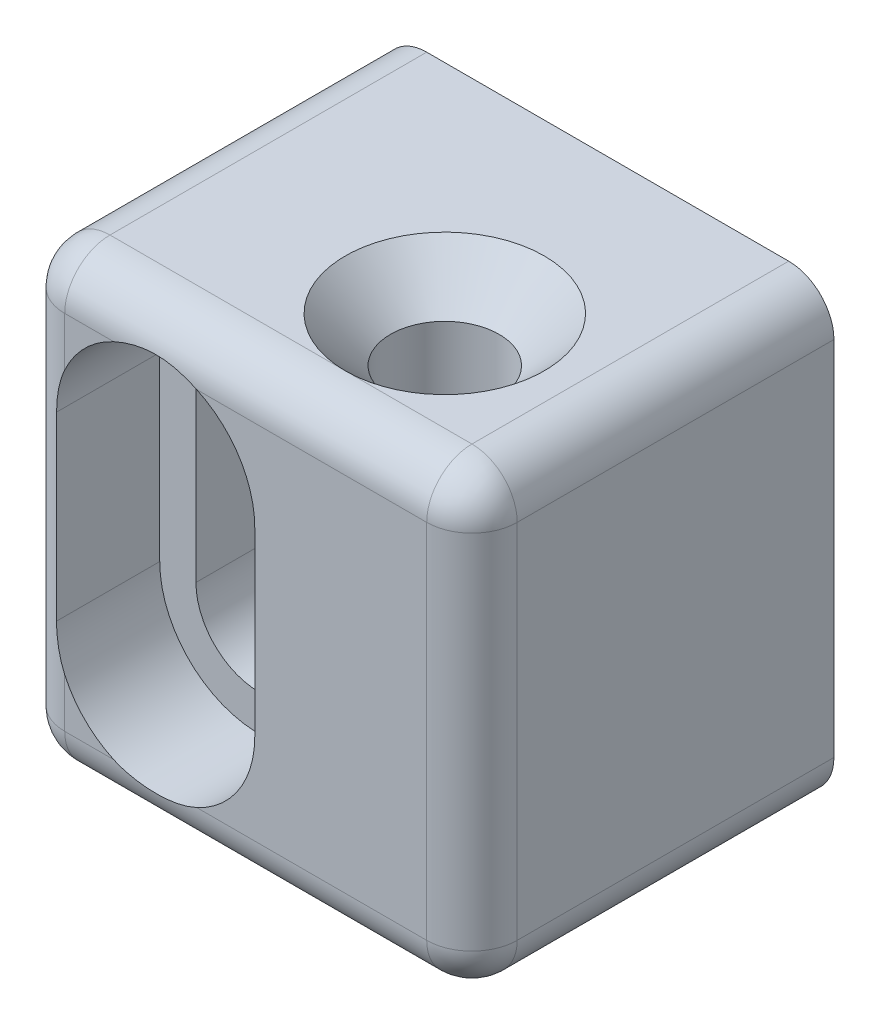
ISO-10303-21;
HEADER;
FILE_DESCRIPTION(('STEP AP214'),'2;1');
FILE_NAME('part.step','',(''),(''),'','','');
FILE_SCHEMA(('AUTOMOTIVE_DESIGN { 1 0 10303 214 1 1 1 1 }'));
ENDSEC;
DATA;
#1=APPLICATION_CONTEXT('core data for automotive mechanical design processes');
#2=APPLICATION_PROTOCOL_DEFINITION('international standard','automotive_design',2000,#1);
#3=PRODUCT_CONTEXT('',#1,'mechanical');
#4=PRODUCT('Part','Part','',(#3));
#5=PRODUCT_RELATED_PRODUCT_CATEGORY('part','',(#4));
#6=PRODUCT_DEFINITION_FORMATION('','',#4);
#7=PRODUCT_DEFINITION_CONTEXT('part definition',#1,'design');
#8=PRODUCT_DEFINITION('design','',#6,#7);
#9=PRODUCT_DEFINITION_SHAPE('','',#8);
#10=(LENGTH_UNIT() NAMED_UNIT(*) SI_UNIT(.MILLI.,.METRE.));
#11=(NAMED_UNIT(*) PLANE_ANGLE_UNIT() SI_UNIT($,.RADIAN.));
#12=(NAMED_UNIT(*) SI_UNIT($,.STERADIAN.) SOLID_ANGLE_UNIT());
#13=UNCERTAINTY_MEASURE_WITH_UNIT(LENGTH_MEASURE(1.E-05),#10,'distance_accuracy_value','');
#14=(GEOMETRIC_REPRESENTATION_CONTEXT(3) GLOBAL_UNCERTAINTY_ASSIGNED_CONTEXT((#13)) GLOBAL_UNIT_ASSIGNED_CONTEXT((#10,
#11,#12)) REPRESENTATION_CONTEXT('',''));
#15=CARTESIAN_POINT('',(0.,0.,0.));
#16=DIRECTION('',(0.,0.,1.));
#17=DIRECTION('',(1.,0.,0.));
#18=AXIS2_PLACEMENT_3D('',#15,#16,#17);
#19=CARTESIAN_POINT('',(-10.,12.5,0.));
#20=DIRECTION('',(0.,1.,0.));
#21=DIRECTION('',(0.,0.,1.));
#22=AXIS2_PLACEMENT_3D('',#19,#20,#21);
#23=PLANE('',#22);
#24=DIRECTION('',(0.,0.,1.));
#25=VECTOR('',#24,1.);
#26=CARTESIAN_POINT('',(10.,12.5,0.));
#27=LINE('',#26,#25);
#28=CARTESIAN_POINT('',(10.,12.5,17.5));
#29=VERTEX_POINT('',#28);
#30=CARTESIAN_POINT('',(10.,12.5,0.));
#31=VERTEX_POINT('',#30);
#32=EDGE_CURVE('E360',#29,#31,#27,.F.);
#33=ORIENTED_EDGE('',*,*,#32,.T.);
#34=DIRECTION('',(1.,0.,0.));
#35=VECTOR('',#34,1.);
#36=CARTESIAN_POINT('',(-10.,12.5,0.));
#37=LINE('',#36,#35);
#38=CARTESIAN_POINT('',(-10.,12.5,0.));
#39=VERTEX_POINT('',#38);
#40=EDGE_CURVE('E368',#31,#39,#37,.F.);
#41=ORIENTED_EDGE('',*,*,#40,.T.);
#42=DIRECTION('',(0.,0.,1.));
#43=VECTOR('',#42,1.);
#44=CARTESIAN_POINT('',(-10.,12.5,0.));
#45=LINE('',#44,#43);
#46=CARTESIAN_POINT('',(-10.,12.5,17.5));
#47=VERTEX_POINT('',#46);
#48=EDGE_CURVE('E353',#47,#39,#45,.F.);
#49=ORIENTED_EDGE('',*,*,#48,.F.);
#50=DIRECTION('',(1.,0.,0.));
#51=VECTOR('',#50,1.);
#52=CARTESIAN_POINT('',(-10.,12.5,17.5));
#53=LINE('',#52,#51);
#54=CARTESIAN_POINT('',(3.,12.5,17.5));
#55=VERTEX_POINT('',#54);
#56=EDGE_CURVE('E216',#47,#55,#53,.T.);
#57=ORIENTED_EDGE('',*,*,#56,.T.);
#58=CARTESIAN_POINT('',(3.,12.5,12.));
#59=DIRECTION('',(0.,1.,0.));
#60=DIRECTION('',(0.,0.,1.));
#61=AXIS2_PLACEMENT_3D('',#58,#59,#60);
#62=CIRCLE('',#61,5.5);
#63=EDGE_CURVE('E32',#55,#55,#62,.F.);
#64=ORIENTED_EDGE('',*,*,#63,.T.);
#65=EDGE_CURVE('E425',#55,#29,#53,.T.);
#66=ORIENTED_EDGE('',*,*,#65,.T.);
#67=EDGE_LOOP('',(#33,#41,#49,#57,#64,#66));
#68=FACE_BOUND('',#67,.T.);
#69=ADVANCED_FACE('F15',(#68),#23,.T.);
#70=CARTESIAN_POINT('',(3.,-12.5,12.));
#71=DIRECTION('',(0.,-1.,0.));
#72=DIRECTION('',(0.,0.,-1.));
#73=AXIS2_PLACEMENT_3D('',#70,#71,#72);
#74=CONICAL_SURFACE('',#73,5.5,0.785398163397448);
#75=CARTESIAN_POINT('',(3.,-10.,12.));
#76=DIRECTION('',(0.,-1.,0.));
#77=DIRECTION('',(0.,0.,-1.));
#78=AXIS2_PLACEMENT_3D('',#75,#76,#77);
#79=CIRCLE('',#78,3.);
#80=CARTESIAN_POINT('',(3.,-10.,9.));
#81=VERTEX_POINT('',#80);
#82=EDGE_CURVE('E340',#81,#81,#79,.T.);
#83=ORIENTED_EDGE('',*,*,#82,.F.);
#84=EDGE_LOOP('',(#83));
#85=FACE_BOUND('',#84,.T.);
#86=CARTESIAN_POINT('',(3.,-12.5,12.));
#87=DIRECTION('',(0.,-1.,0.));
#88=DIRECTION('',(0.,0.,-1.));
#89=AXIS2_PLACEMENT_3D('',#86,#87,#88);
#90=CIRCLE('',#89,5.5);
#91=CARTESIAN_POINT('',(3.,-12.5,17.5));
#92=VERTEX_POINT('',#91);
#93=EDGE_CURVE('E378',#92,#92,#90,.T.);
#94=ORIENTED_EDGE('',*,*,#93,.T.);
#95=EDGE_LOOP('',(#94));
#96=FACE_BOUND('',#95,.T.);
#97=ADVANCED_FACE('F265',(#85,#96),#74,.F.);
#98=CARTESIAN_POINT('',(3.,-10.,12.));
#99=DIRECTION('',(0.,1.,0.));
#100=DIRECTION('',(0.,0.,1.));
#101=AXIS2_PLACEMENT_3D('',#98,#99,#100);
#102=CYLINDRICAL_SURFACE('',#101,3.);
#103=ORIENTED_EDGE('',*,*,#82,.T.);
#104=EDGE_LOOP('',(#103));
#105=FACE_BOUND('',#104,.T.);
#106=CARTESIAN_POINT('',(3.,10.,12.));
#107=DIRECTION('',(0.,1.,0.));
#108=DIRECTION('',(0.,0.,1.));
#109=AXIS2_PLACEMENT_3D('',#106,#107,#108);
#110=CIRCLE('',#109,3.);
#111=CARTESIAN_POINT('',(3.,10.,15.));
#112=VERTEX_POINT('',#111);
#113=EDGE_CURVE('E343',#112,#112,#110,.T.);
#114=ORIENTED_EDGE('',*,*,#113,.T.);
#115=EDGE_LOOP('',(#114));
#116=FACE_BOUND('',#115,.T.);
#117=ADVANCED_FACE('F431',(#105,#116),#102,.F.);
#118=CARTESIAN_POINT('',(3.,12.5,12.));
#119=DIRECTION('',(0.,1.,0.));
#120=DIRECTION('',(0.,0.,1.));
#121=AXIS2_PLACEMENT_3D('',#118,#119,#120);
#122=CONICAL_SURFACE('',#121,5.5,0.785398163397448);
#123=ORIENTED_EDGE('',*,*,#113,.F.);
#124=EDGE_LOOP('',(#123));
#125=FACE_BOUND('',#124,.T.);
#126=ORIENTED_EDGE('',*,*,#63,.F.);
#127=EDGE_LOOP('',(#126));
#128=FACE_BOUND('',#127,.T.);
#129=ADVANCED_FACE('F429',(#125,#128),#122,.F.);
#130=CARTESIAN_POINT('',(5.,-10.,17.5));
#131=DIRECTION('',(-1.,0.,0.));
#132=DIRECTION('',(0.,0.,1.));
#133=AXIS2_PLACEMENT_3D('',#130,#131,#132);
#134=CYLINDRICAL_SURFACE('',#133,2.5);
#135=CARTESIAN_POINT('',(10.,-10.,17.5));
#136=DIRECTION('',(1.,0.,0.));
#137=DIRECTION('',(0.,1.,0.));
#138=AXIS2_PLACEMENT_3D('',#135,#136,#137);
#139=CIRCLE('',#138,2.5);
#140=CARTESIAN_POINT('',(10.,-10.,20.));
#141=VERTEX_POINT('',#140);
#142=CARTESIAN_POINT('',(9.999999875,-12.5,17.5));
#143=VERTEX_POINT('',#142);
#144=EDGE_CURVE('E160',#141,#143,#139,.T.);
#145=ORIENTED_EDGE('',*,*,#144,.F.);
#146=DIRECTION('',(-1.,0.,0.));
#147=VECTOR('',#146,1.);
#148=CARTESIAN_POINT('',(5.,-10.,20.));
#149=LINE('',#148,#147);
#150=CARTESIAN_POINT('',(-2.70871256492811,-10.,20.));
#151=VERTEX_POINT('',#150);
#152=EDGE_CURVE('E163',#141,#151,#149,.T.);
#153=ORIENTED_EDGE('',*,*,#152,.T.);
#154=CARTESIAN_POINT('',(-2.70871256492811,-10.,20.));
#155=CARTESIAN_POINT('',(-2.7782256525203,-10.0318550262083,19.9999964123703));
#156=CARTESIAN_POINT('',(-2.8483912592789,-10.062254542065,19.9993916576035));
#157=CARTESIAN_POINT('',(-2.98991172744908,-10.1200963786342,19.9972820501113));
#158=CARTESIAN_POINT('',(-3.06126649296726,-10.1475389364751,19.9957772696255));
#159=CARTESIAN_POINT('',(-3.27691854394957,-10.2253550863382,19.9903669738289));
#160=CARTESIAN_POINT('',(-3.42284164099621,-10.2712345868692,19.9855651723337));
#161=CARTESIAN_POINT('',(-3.71785320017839,-10.3506468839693,19.9756104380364));
#162=CARTESIAN_POINT('',(-3.86693911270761,-10.384189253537,19.9704577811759));
#163=CARTESIAN_POINT('',(-4.16742132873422,-10.4387610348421,19.961352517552));
#164=CARTESIAN_POINT('',(-4.3188175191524,-10.4597910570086,19.9573998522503));
#165=CARTESIAN_POINT('',(-4.62402693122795,-10.4892917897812,19.951698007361));
#166=CARTESIAN_POINT('',(-4.77784977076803,-10.4976665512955,19.9499656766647));
#167=CARTESIAN_POINT('',(-5.0856758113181,-10.5014864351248,19.9491866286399));
#168=CARTESIAN_POINT('',(-5.23967902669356,-10.4969304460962,19.9501401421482));
#169=CARTESIAN_POINT('',(-5.54656990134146,-10.4749337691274,19.9544984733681));
#170=CARTESIAN_POINT('',(-5.69945853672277,-10.4575062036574,19.9579007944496));
#171=CARTESIAN_POINT('',(-6.00314057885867,-10.4099290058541,19.9662799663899));
#172=CARTESIAN_POINT('',(-6.15393453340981,-10.3797827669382,19.9712563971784));
#173=CARTESIAN_POINT('',(-6.47291154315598,-10.3019824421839,19.9820479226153));
#174=CARTESIAN_POINT('',(-6.64065463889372,-10.2524986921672,19.9878846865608));
#175=CARTESIAN_POINT('',(-6.88805135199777,-10.166515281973,19.9946120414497));
#176=CARTESIAN_POINT('',(-6.96977113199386,-10.1359141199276,19.9965160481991));
#177=CARTESIAN_POINT('',(-7.1317056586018,-10.0708424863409,19.9992072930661));
#178=CARTESIAN_POINT('',(-7.21191987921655,-10.0363706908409,19.999994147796));
#179=CARTESIAN_POINT('',(-7.29128743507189,-10.,20.));
#180=B_SPLINE_CURVE_WITH_KNOTS('',3,(#154,#155,#156,#157,#158,#159,#160,#161,#162,#163,#164,
#165,#166,#167,#168,#169,#170,#171,#172,#173,#174,#175,#176,#177,#178,#179),.UNSPECIFIED.,.F.,
.F.,(4,2,2,2,2,2,2,2,2,2,2,2,4),(0.,0.229350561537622,0.458682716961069,0.917221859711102,
1.37540444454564,1.83356467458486,2.29518143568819,2.75683787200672,3.21802430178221,
3.67908776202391,4.20316272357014,4.46491890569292,4.72676489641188),.UNSPECIFIED.);
#181=CARTESIAN_POINT('',(-7.29128743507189,-10.,20.));
#182=VERTEX_POINT('',#181);
#183=EDGE_CURVE('E179',#151,#182,#180,.T.);
#184=ORIENTED_EDGE('',*,*,#183,.T.);
#185=DIRECTION('',(-1.,0.,0.));
#186=VECTOR('',#185,1.);
#187=CARTESIAN_POINT('',(5.,-10.,20.));
#188=LINE('',#187,#186);
#189=CARTESIAN_POINT('',(-10.,-10.,20.));
#190=VERTEX_POINT('',#189);
#191=EDGE_CURVE('E335',#182,#190,#188,.T.);
#192=ORIENTED_EDGE('',*,*,#191,.T.);
#193=CARTESIAN_POINT('',(-10.,-10.,17.5));
#194=DIRECTION('',(-1.,0.,0.));
#195=DIRECTION('',(0.,0.,1.));
#196=AXIS2_PLACEMENT_3D('',#193,#194,#195);
#197=CIRCLE('',#196,2.5);
#198=CARTESIAN_POINT('',(-10.,-12.5,17.5));
#199=VERTEX_POINT('',#198);
#200=EDGE_CURVE('E329',#190,#199,#197,.F.);
#201=ORIENTED_EDGE('',*,*,#200,.T.);
#202=DIRECTION('',(1.,0.,0.));
#203=VECTOR('',#202,1.);
#204=CARTESIAN_POINT('',(0.,-12.5,17.5));
#205=LINE('',#204,#203);
#206=EDGE_CURVE('E380',#199,#92,#205,.T.);
#207=ORIENTED_EDGE('',*,*,#206,.T.);
#208=DIRECTION('',(1.,0.,0.));
#209=VECTOR('',#208,1.);
#210=CARTESIAN_POINT('',(0.,-12.5,17.5));
#211=LINE('',#210,#209);
#212=EDGE_CURVE('E18',#92,#143,#211,.T.);
#213=ORIENTED_EDGE('',*,*,#212,.T.);
#214=EDGE_LOOP('',(#145,#153,#184,#192,#201,#207,#213));
#215=FACE_BOUND('',#214,.T.);
#216=ADVANCED_FACE('F162',(#215),#134,.T.);
#217=CARTESIAN_POINT('',(10.,-10.,17.5));
#218=DIRECTION('',(1.,0.,0.));
#219=DIRECTION('',(0.,1.,0.));
#220=AXIS2_PLACEMENT_3D('',#217,#218,#219);
#221=SPHERICAL_SURFACE('',#220,2.5);
#222=CARTESIAN_POINT('',(10.,-10.,17.5));
#223=DIRECTION('',(0.,0.,1.));
#224=DIRECTION('',(1.,0.,0.));
#225=AXIS2_PLACEMENT_3D('',#222,#223,#224);
#226=CIRCLE('',#225,2.5);
#227=CARTESIAN_POINT('',(12.5,-10.,17.5));
#228=VERTEX_POINT('',#227);
#229=EDGE_CURVE('E184',#228,#143,#226,.F.);
#230=ORIENTED_EDGE('',*,*,#229,.F.);
#231=CARTESIAN_POINT('',(10.,-10.,17.5));
#232=DIRECTION('',(0.,-1.,0.));
#233=DIRECTION('',(0.,0.,-1.));
#234=AXIS2_PLACEMENT_3D('',#231,#232,#233);
#235=CIRCLE('',#234,2.5);
#236=EDGE_CURVE('E182',#141,#228,#235,.F.);
#237=ORIENTED_EDGE('',*,*,#236,.F.);
#238=ORIENTED_EDGE('',*,*,#144,.T.);
#239=EDGE_LOOP('',(#230,#237,#238));
#240=FACE_BOUND('',#239,.T.);
#241=ADVANCED_FACE('F183',(#240),#221,.T.);
#242=CARTESIAN_POINT('',(0.,0.,0.));
#243=DIRECTION('',(0.,0.,1.));
#244=DIRECTION('',(1.,0.,0.));
#245=AXIS2_PLACEMENT_3D('',#242,#243,#244);
#246=PLANE('',#245);
#247=CARTESIAN_POINT('',(-5.,-4.99999981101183,0.));
#248=DIRECTION('',(0.,0.,1.));
#249=DIRECTION('',(1.,0.,0.));
#250=AXIS2_PLACEMENT_3D('',#247,#248,#249);
#251=CIRCLE('',#250,3.5);
#252=CARTESIAN_POINT('',(-1.5,-4.99999981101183,0.));
#253=VERTEX_POINT('',#252);
#254=CARTESIAN_POINT('',(-8.5,-4.99999981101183,0.));
#255=VERTEX_POINT('',#254);
#256=EDGE_CURVE('E188',#253,#255,#251,.F.);
#257=ORIENTED_EDGE('',*,*,#256,.F.);
#258=DIRECTION('',(0.,1.,0.));
#259=VECTOR('',#258,1.);
#260=CARTESIAN_POINT('',(-1.5,0.,0.));
#261=LINE('',#260,#259);
#262=CARTESIAN_POINT('',(-1.5,5.00000018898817,0.));
#263=VERTEX_POINT('',#262);
#264=EDGE_CURVE('E571',#263,#253,#261,.F.);
#265=ORIENTED_EDGE('',*,*,#264,.F.);
#266=CARTESIAN_POINT('',(-5.,5.00000018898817,0.));
#267=DIRECTION('',(0.,0.,1.));
#268=DIRECTION('',(1.,0.,0.));
#269=AXIS2_PLACEMENT_3D('',#266,#267,#268);
#270=CIRCLE('',#269,3.5);
#271=CARTESIAN_POINT('',(-8.5,5.00000018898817,0.));
#272=VERTEX_POINT('',#271);
#273=EDGE_CURVE('E567',#272,#263,#270,.F.);
#274=ORIENTED_EDGE('',*,*,#273,.F.);
#275=DIRECTION('',(0.,1.,0.));
#276=VECTOR('',#275,1.);
#277=CARTESIAN_POINT('',(-8.5,0.,0.));
#278=LINE('',#277,#276);
#279=EDGE_CURVE('E371',#255,#272,#278,.T.);
#280=ORIENTED_EDGE('',*,*,#279,.F.);
#281=EDGE_LOOP('',(#257,#265,#274,#280));
#282=FACE_BOUND('',#281,.T.);
#283=ORIENTED_EDGE('',*,*,#40,.F.);
#284=CARTESIAN_POINT('',(10.,10.,0.));
#285=DIRECTION('',(0.,0.,1.));
#286=DIRECTION('',(1.,0.,0.));
#287=AXIS2_PLACEMENT_3D('',#284,#285,#286);
#288=CIRCLE('',#287,2.5);
#289=CARTESIAN_POINT('',(12.5,10.,0.));
#290=VERTEX_POINT('',#289);
#291=EDGE_CURVE('E370',#290,#31,#288,.T.);
#292=ORIENTED_EDGE('',*,*,#291,.F.);
#293=DIRECTION('',(0.,1.,0.));
#294=VECTOR('',#293,1.);
#295=CARTESIAN_POINT('',(12.5,0.,0.));
#296=LINE('',#295,#294);
#297=CARTESIAN_POINT('',(12.5,-10.,0.));
#298=VERTEX_POINT('',#297);
#299=EDGE_CURVE('E326',#298,#290,#296,.T.);
#300=ORIENTED_EDGE('',*,*,#299,.F.);
#301=CARTESIAN_POINT('',(10.,-10.,0.));
#302=DIRECTION('',(0.,0.,1.));
#303=DIRECTION('',(1.,0.,0.));
#304=AXIS2_PLACEMENT_3D('',#301,#302,#303);
#305=CIRCLE('',#304,2.5);
#306=CARTESIAN_POINT('',(10.,-12.5,0.));
#307=VERTEX_POINT('',#306);
#308=EDGE_CURVE('E323',#307,#298,#305,.T.);
#309=ORIENTED_EDGE('',*,*,#308,.F.);
#310=DIRECTION('',(1.,0.,0.));
#311=VECTOR('',#310,1.);
#312=CARTESIAN_POINT('',(0.,-12.5,0.));
#313=LINE('',#312,#311);
#314=CARTESIAN_POINT('',(-10.,-12.5,0.));
#315=VERTEX_POINT('',#314);
#316=EDGE_CURVE('E24',#315,#307,#313,.T.);
#317=ORIENTED_EDGE('',*,*,#316,.F.);
#318=CARTESIAN_POINT('',(-10.,-10.,0.));
#319=DIRECTION('',(0.,0.,1.));
#320=DIRECTION('',(1.,0.,0.));
#321=AXIS2_PLACEMENT_3D('',#318,#319,#320);
#322=CIRCLE('',#321,2.5);
#323=CARTESIAN_POINT('',(-12.5,-10.,0.));
#324=VERTEX_POINT('',#323);
#325=EDGE_CURVE('E325',#324,#315,#322,.T.);
#326=ORIENTED_EDGE('',*,*,#325,.F.);
#327=DIRECTION('',(0.,1.,0.));
#328=VECTOR('',#327,1.);
#329=CARTESIAN_POINT('',(-12.5,0.,0.));
#330=LINE('',#329,#328);
#331=CARTESIAN_POINT('',(-12.5,10.,0.));
#332=VERTEX_POINT('',#331);
#333=EDGE_CURVE('E332',#332,#324,#330,.F.);
#334=ORIENTED_EDGE('',*,*,#333,.F.);
#335=CARTESIAN_POINT('',(-10.,10.,0.));
#336=DIRECTION('',(0.,0.,1.));
#337=DIRECTION('',(1.,0.,0.));
#338=AXIS2_PLACEMENT_3D('',#335,#336,#337);
#339=CIRCLE('',#338,2.5);
#340=EDGE_CURVE('E363',#39,#332,#339,.T.);
#341=ORIENTED_EDGE('',*,*,#340,.F.);
#342=EDGE_LOOP('',(#283,#292,#300,#309,#317,#326,#334,#341));
#343=FACE_BOUND('',#342,.T.);
#344=ADVANCED_FACE('F396',(#282,#343),#246,.F.);
#345=CARTESIAN_POINT('',(10.,10.,0.));
#346=DIRECTION('',(0.,0.,1.));
#347=DIRECTION('',(1.,0.,0.));
#348=AXIS2_PLACEMENT_3D('',#345,#346,#347);
#349=CYLINDRICAL_SURFACE('',#348,2.5);
#350=ORIENTED_EDGE('',*,*,#291,.T.);
#351=ORIENTED_EDGE('',*,*,#32,.F.);
#352=CARTESIAN_POINT('',(10.,10.,17.5));
#353=DIRECTION('',(0.,0.,1.));
#354=DIRECTION('',(1.,0.,0.));
#355=AXIS2_PLACEMENT_3D('',#352,#353,#354);
#356=CIRCLE('',#355,2.5);
#357=CARTESIAN_POINT('',(12.5,10.,17.5));
#358=VERTEX_POINT('',#357);
#359=EDGE_CURVE('E362',#29,#358,#356,.F.);
#360=ORIENTED_EDGE('',*,*,#359,.T.);
#361=DIRECTION('',(0.,0.,1.));
#362=VECTOR('',#361,1.);
#363=CARTESIAN_POINT('',(12.5,10.,0.));
#364=LINE('',#363,#362);
#365=EDGE_CURVE('E365',#358,#290,#364,.F.);
#366=ORIENTED_EDGE('',*,*,#365,.T.);
#367=EDGE_LOOP('',(#350,#351,#360,#366));
#368=FACE_BOUND('',#367,.T.);
#369=ADVANCED_FACE('F518',(#368),#349,.T.);
#370=CARTESIAN_POINT('',(10.,-10.,0.));
#371=DIRECTION('',(0.,0.,1.));
#372=DIRECTION('',(1.,0.,0.));
#373=AXIS2_PLACEMENT_3D('',#370,#371,#372);
#374=CYLINDRICAL_SURFACE('',#373,2.5);
#375=ORIENTED_EDGE('',*,*,#308,.T.);
#376=DIRECTION('',(0.,0.,-1.));
#377=VECTOR('',#376,1.);
#378=CARTESIAN_POINT('',(12.5,-10.,0.));
#379=LINE('',#378,#377);
#380=EDGE_CURVE('E339',#228,#298,#379,.T.);
#381=ORIENTED_EDGE('',*,*,#380,.F.);
#382=ORIENTED_EDGE('',*,*,#229,.T.);
#383=DIRECTION('',(0.,0.,1.));
#384=VECTOR('',#383,1.);
#385=CARTESIAN_POINT('',(10.,-12.5,8.75));
#386=LINE('',#385,#384);
#387=EDGE_CURVE('E10',#307,#143,#386,.T.);
#388=ORIENTED_EDGE('',*,*,#387,.F.);
#389=EDGE_LOOP('',(#375,#381,#382,#388));
#390=FACE_BOUND('',#389,.T.);
#391=ADVANCED_FACE('F392',(#390),#374,.T.);
#392=CARTESIAN_POINT('',(-10.,-10.,0.));
#393=DIRECTION('',(0.,0.,1.));
#394=DIRECTION('',(1.,0.,0.));
#395=AXIS2_PLACEMENT_3D('',#392,#393,#394);
#396=CYLINDRICAL_SURFACE('',#395,2.5);
#397=ORIENTED_EDGE('',*,*,#325,.T.);
#398=DIRECTION('',(0.,0.,-1.));
#399=VECTOR('',#398,1.);
#400=CARTESIAN_POINT('',(-10.,-12.5,8.75));
#401=LINE('',#400,#399);
#402=EDGE_CURVE('E384',#199,#315,#401,.T.);
#403=ORIENTED_EDGE('',*,*,#402,.F.);
#404=CARTESIAN_POINT('',(-10.,-10.,17.5));
#405=DIRECTION('',(0.,0.,1.));
#406=DIRECTION('',(1.,0.,0.));
#407=AXIS2_PLACEMENT_3D('',#404,#405,#406);
#408=CIRCLE('',#407,2.5);
#409=CARTESIAN_POINT('',(-12.5,-10.,17.5));
#410=VERTEX_POINT('',#409);
#411=EDGE_CURVE('E336',#199,#410,#408,.F.);
#412=ORIENTED_EDGE('',*,*,#411,.T.);
#413=DIRECTION('',(0.,0.,1.));
#414=VECTOR('',#413,1.);
#415=CARTESIAN_POINT('',(-12.5,-10.,0.));
#416=LINE('',#415,#414);
#417=EDGE_CURVE('E338',#410,#324,#416,.F.);
#418=ORIENTED_EDGE('',*,*,#417,.T.);
#419=EDGE_LOOP('',(#397,#403,#412,#418));
#420=FACE_BOUND('',#419,.T.);
#421=ADVANCED_FACE('F506',(#420),#396,.T.);
#422=CARTESIAN_POINT('',(-10.,10.,0.));
#423=DIRECTION('',(0.,0.,1.));
#424=DIRECTION('',(1.,0.,0.));
#425=AXIS2_PLACEMENT_3D('',#422,#423,#424);
#426=CYLINDRICAL_SURFACE('',#425,2.5);
#427=ORIENTED_EDGE('',*,*,#340,.T.);
#428=DIRECTION('',(0.,0.,1.));
#429=VECTOR('',#428,1.);
#430=CARTESIAN_POINT('',(-12.5,10.,0.));
#431=LINE('',#430,#429);
#432=CARTESIAN_POINT('',(-12.5,10.,17.5));
#433=VERTEX_POINT('',#432);
#434=EDGE_CURVE('E354',#332,#433,#431,.T.);
#435=ORIENTED_EDGE('',*,*,#434,.T.);
#436=CARTESIAN_POINT('',(-10.,10.,17.5));
#437=DIRECTION('',(0.,0.,1.));
#438=DIRECTION('',(1.,0.,0.));
#439=AXIS2_PLACEMENT_3D('',#436,#437,#438);
#440=CIRCLE('',#439,2.5);
#441=EDGE_CURVE('E350',#433,#47,#440,.F.);
#442=ORIENTED_EDGE('',*,*,#441,.T.);
#443=ORIENTED_EDGE('',*,*,#48,.T.);
#444=EDGE_LOOP('',(#427,#435,#442,#443));
#445=FACE_BOUND('',#444,.T.);
#446=ADVANCED_FACE('F509',(#445),#426,.T.);
#447=CARTESIAN_POINT('',(0.,0.,20.));
#448=DIRECTION('',(0.,0.,1.));
#449=DIRECTION('',(1.,0.,0.));
#450=AXIS2_PLACEMENT_3D('',#447,#448,#449);
#451=PLANE('',#450);
#452=DIRECTION('',(0.,1.,0.));
#453=VECTOR('',#452,1.);
#454=CARTESIAN_POINT('',(0.500000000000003,-4.99999981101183,20.));
#455=LINE('',#454,#453);
#456=CARTESIAN_POINT('',(0.500000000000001,5.00000018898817,20.));
#457=VERTEX_POINT('',#456);
#458=CARTESIAN_POINT('',(0.500000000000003,-4.99999981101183,20.));
#459=VERTEX_POINT('',#458);
#460=EDGE_CURVE('E198',#457,#459,#455,.F.);
#461=ORIENTED_EDGE('',*,*,#460,.T.);
#462=CARTESIAN_POINT('',(-5.,-4.99999981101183,20.));
#463=DIRECTION('',(0.,0.,-1.));
#464=DIRECTION('',(-1.,0.,0.));
#465=AXIS2_PLACEMENT_3D('',#462,#463,#464);
#466=CIRCLE('',#465,5.5);
#467=EDGE_CURVE('E178',#459,#151,#466,.T.);
#468=ORIENTED_EDGE('',*,*,#467,.T.);
#469=ORIENTED_EDGE('',*,*,#152,.F.);
#470=DIRECTION('',(0.,-1.,0.));
#471=VECTOR('',#470,1.);
#472=CARTESIAN_POINT('',(10.,5.,20.));
#473=LINE('',#472,#471);
#474=CARTESIAN_POINT('',(10.,10.,20.));
#475=VERTEX_POINT('',#474);
#476=EDGE_CURVE('E175',#475,#141,#473,.T.);
#477=ORIENTED_EDGE('',*,*,#476,.F.);
#478=DIRECTION('',(1.,0.,0.));
#479=VECTOR('',#478,1.);
#480=CARTESIAN_POINT('',(-5.,10.,20.));
#481=LINE('',#480,#479);
#482=CARTESIAN_POINT('',(-2.70871174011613,10.,20.));
#483=VERTEX_POINT('',#482);
#484=EDGE_CURVE('E194',#483,#475,#481,.T.);
#485=ORIENTED_EDGE('',*,*,#484,.F.);
#486=CARTESIAN_POINT('',(-5.,5.00000018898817,20.));
#487=DIRECTION('',(0.,0.,-1.));
#488=DIRECTION('',(-1.,0.,0.));
#489=AXIS2_PLACEMENT_3D('',#486,#487,#488);
#490=CIRCLE('',#489,5.5);
#491=EDGE_CURVE('E196',#483,#457,#490,.T.);
#492=ORIENTED_EDGE('',*,*,#491,.T.);
#493=EDGE_LOOP('',(#461,#468,#469,#477,#485,#492));
#494=FACE_BOUND('',#493,.T.);
#495=ADVANCED_FACE('F173',(#494),#451,.T.);
#496=CARTESIAN_POINT('',(-5.,10.,17.5));
#497=DIRECTION('',(1.,0.,0.));
#498=DIRECTION('',(0.,0.,-1.));
#499=AXIS2_PLACEMENT_3D('',#496,#497,#498);
#500=CYLINDRICAL_SURFACE('',#499,2.5);
#501=CARTESIAN_POINT('',(-10.,10.,17.5));
#502=DIRECTION('',(1.,0.,0.));
#503=DIRECTION('',(0.,1.,0.));
#504=AXIS2_PLACEMENT_3D('',#501,#502,#503);
#505=CIRCLE('',#504,2.5);
#506=CARTESIAN_POINT('',(-10.,10.,20.));
#507=VERTEX_POINT('',#506);
#508=EDGE_CURVE('E204',#507,#47,#505,.F.);
#509=ORIENTED_EDGE('',*,*,#508,.F.);
#510=DIRECTION('',(1.,0.,0.));
#511=VECTOR('',#510,1.);
#512=CARTESIAN_POINT('',(-5.,10.,20.));
#513=LINE('',#512,#511);
#514=CARTESIAN_POINT('',(-7.29128825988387,10.,20.));
#515=VERTEX_POINT('',#514);
#516=EDGE_CURVE('E205',#507,#515,#513,.T.);
#517=ORIENTED_EDGE('',*,*,#516,.T.);
#518=CARTESIAN_POINT('',(-7.29128825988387,10.,20.));
#519=CARTESIAN_POINT('',(-7.22177517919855,10.0318550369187,19.9999964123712));
#520=CARTESIAN_POINT('',(-7.15160957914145,10.0622545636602,19.999391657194));
#521=CARTESIAN_POINT('',(-7.01008912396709,10.1200964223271,19.9972820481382));
#522=CARTESIAN_POINT('',(-6.93873436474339,10.1475389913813,19.9957772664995));
#523=CARTESIAN_POINT('',(-6.72308233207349,10.2253551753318,19.9903669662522));
#524=CARTESIAN_POINT('',(-6.57715924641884,10.2712346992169,19.9855651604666));
#525=CARTESIAN_POINT('',(-6.28214770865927,10.3506470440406,19.9756104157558));
#526=CARTESIAN_POINT('',(-6.13306180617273,10.3841894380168,19.9704577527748));
#527=CARTESIAN_POINT('',(-5.83257960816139,10.438761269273,19.9613524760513));
#528=CARTESIAN_POINT('',(-5.68118342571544,10.4597913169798,19.9573998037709));
#529=CARTESIAN_POINT('',(-5.37597402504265,10.4892921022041,19.9516979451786));
#530=CARTESIAN_POINT('',(-5.22215118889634,10.4976668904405,19.9499656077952));
#531=CARTESIAN_POINT('',(-4.91432515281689,10.5014868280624,19.9491865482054));
#532=CARTESIAN_POINT('',(-4.76032193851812,10.4969308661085,19.9501400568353));
#533=CARTESIAN_POINT('',(-4.4534310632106,10.4749342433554,19.9544983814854));
#534=CARTESIAN_POINT('',(-4.30054242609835,10.4575067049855,19.9579007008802));
#535=CARTESIAN_POINT('',(-3.99686037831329,10.4099295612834,19.9662798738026));
#536=CARTESIAN_POINT('',(-3.84606641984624,10.3797833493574,19.97125630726));
#537=CARTESIAN_POINT('',(-3.52708909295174,10.3019830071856,19.9820478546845));
#538=CARTESIAN_POINT('',(-3.35934569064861,10.2524991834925,19.9878846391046));
#539=CARTESIAN_POINT('',(-3.11194853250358,10.1665156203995,19.994612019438));
#540=CARTESIAN_POINT('',(-3.03022860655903,10.1359144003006,19.9965160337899));
#541=CARTESIAN_POINT('',(-2.86829379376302,10.0708426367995,19.9992072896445));
#542=CARTESIAN_POINT('',(-2.78807943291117,10.0363707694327,19.9999941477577));
#543=CARTESIAN_POINT('',(-2.70871174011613,10.,20.));
#544=B_SPLINE_CURVE_WITH_KNOTS('',3,(#518,#519,#520,#521,#522,#523,#524,#525,#526,#527,#528,
#529,#530,#531,#532,#533,#534,#535,#536,#537,#538,#539,#540,#541,#542,#543),.UNSPECIFIED.,.F.,
.F.,(4,2,2,2,2,2,2,2,2,2,2,2,4),(0.,0.229350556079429,0.458682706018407,0.917221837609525,
1.37540440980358,1.83356462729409,2.29518138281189,2.75683781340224,3.21802423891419,
3.67908769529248,4.20316359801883,4.46492025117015,4.72676671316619),.UNSPECIFIED.);
#545=EDGE_CURVE('E207',#515,#483,#544,.T.);
#546=ORIENTED_EDGE('',*,*,#545,.T.);
#547=ORIENTED_EDGE('',*,*,#484,.T.);
#548=CARTESIAN_POINT('',(10.,10.,17.5));
#549=DIRECTION('',(1.,0.,0.));
#550=DIRECTION('',(0.,0.,-1.));
#551=AXIS2_PLACEMENT_3D('',#548,#549,#550);
#552=CIRCLE('',#551,2.5);
#553=EDGE_CURVE('E215',#475,#29,#552,.F.);
#554=ORIENTED_EDGE('',*,*,#553,.T.);
#555=ORIENTED_EDGE('',*,*,#65,.F.);
#556=ORIENTED_EDGE('',*,*,#56,.F.);
#557=EDGE_LOOP('',(#509,#517,#546,#547,#554,#555,#556));
#558=FACE_BOUND('',#557,.T.);
#559=ADVANCED_FACE('F222',(#558),#500,.T.);
#560=CARTESIAN_POINT('',(-5.,-4.99999981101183,20.));
#561=DIRECTION('',(0.,0.,-1.));
#562=DIRECTION('',(-1.,0.,0.));
#563=AXIS2_PLACEMENT_3D('',#560,#561,#562);
#564=CYLINDRICAL_SURFACE('',#563,5.5);
#565=ORIENTED_EDGE('',*,*,#467,.F.);
#566=DIRECTION('',(0.,0.,-1.));
#567=VECTOR('',#566,1.);
#568=CARTESIAN_POINT('',(0.500000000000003,-4.99999981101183,20.));
#569=LINE('',#568,#567);
#570=CARTESIAN_POINT('',(0.500000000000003,-4.99999981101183,14.25));
#571=VERTEX_POINT('',#570);
#572=EDGE_CURVE('E419',#459,#571,#569,.T.);
#573=ORIENTED_EDGE('',*,*,#572,.T.);
#574=CARTESIAN_POINT('',(-5.,-4.99999981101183,14.25));
#575=DIRECTION('',(0.,0.,-1.));
#576=DIRECTION('',(-1.,0.,0.));
#577=AXIS2_PLACEMENT_3D('',#574,#575,#576);
#578=CIRCLE('',#577,5.5);
#579=CARTESIAN_POINT('',(-10.5,-4.99999981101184,14.25));
#580=VERTEX_POINT('',#579);
#581=EDGE_CURVE('E424',#580,#571,#578,.F.);
#582=ORIENTED_EDGE('',*,*,#581,.F.);
#583=DIRECTION('',(0.,0.,1.));
#584=VECTOR('',#583,1.);
#585=CARTESIAN_POINT('',(-10.5,-4.99999981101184,20.));
#586=LINE('',#585,#584);
#587=CARTESIAN_POINT('',(-10.5,-4.99999981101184,19.9494897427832));
#588=VERTEX_POINT('',#587);
#589=EDGE_CURVE('E253',#580,#588,#586,.T.);
#590=ORIENTED_EDGE('',*,*,#589,.T.);
#591=CARTESIAN_POINT('',(-10.,-7.29128765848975,20.));
#592=CARTESIAN_POINT('',(-10.0321192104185,-7.22119792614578,19.9999963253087));
#593=CARTESIAN_POINT('',(-10.0627585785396,-7.1504452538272,19.9993815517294));
#594=CARTESIAN_POINT('',(-10.1210307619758,-7.00773121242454,19.9972394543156));
#595=CARTESIAN_POINT('',(-10.1486637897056,-6.93576992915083,19.9957121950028));
#596=CARTESIAN_POINT('',(-10.2270035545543,-6.71819506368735,19.9902249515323));
#597=CARTESIAN_POINT('',(-10.2731337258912,-6.57092811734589,19.985359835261));
#598=CARTESIAN_POINT('',(-10.3521469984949,-6.27572156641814,19.975388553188));
#599=CARTESIAN_POINT('',(-10.3852505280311,-6.12784021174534,19.9702881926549));
#600=CARTESIAN_POINT('',(-10.4391342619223,-5.82988613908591,19.9612825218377));
#601=CARTESIAN_POINT('',(-10.4599224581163,-5.67981490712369,19.9573764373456));
#602=CARTESIAN_POINT('',(-10.4829623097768,-5.44146428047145,19.9529202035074));
#603=CARTESIAN_POINT('',(-10.4893300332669,-5.35357643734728,19.9516497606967));
#604=CARTESIAN_POINT('',(-10.4978602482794,-5.17713019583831,19.9499270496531));
#605=CARTESIAN_POINT('',(-10.5000006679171,-5.08857068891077,19.9494790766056));
#606=CARTESIAN_POINT('',(-10.5,-4.99999981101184,19.9494897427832));
#607=B_SPLINE_CURVE_WITH_KNOTS('',3,(#591,#592,#593,#594,#595,#596,#597,#598,#599,#600,#601,
#602,#603,#604,#605,#606),.UNSPECIFIED.,.F.,.F.,(4,2,2,2,2,2,2,4),(0.,0.231251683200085,
0.462487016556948,0.925081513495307,1.37947186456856,1.83356702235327,2.09785401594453,
2.36351731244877),.UNSPECIFIED.);
#608=CARTESIAN_POINT('',(-10.,-7.29128765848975,20.));
#609=VERTEX_POINT('',#608);
#610=EDGE_CURVE('E244',#609,#588,#607,.T.);
#611=ORIENTED_EDGE('',*,*,#610,.F.);
#612=CARTESIAN_POINT('',(-5.,-4.99999981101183,20.));
#613=DIRECTION('',(0.,0.,-1.));
#614=DIRECTION('',(-1.,0.,0.));
#615=AXIS2_PLACEMENT_3D('',#612,#613,#614);
#616=CIRCLE('',#615,5.5);
#617=EDGE_CURVE('E252',#182,#609,#616,.T.);
#618=ORIENTED_EDGE('',*,*,#617,.F.);
#619=ORIENTED_EDGE('',*,*,#183,.F.);
#620=EDGE_LOOP('',(#565,#573,#582,#590,#611,#618,#619));
#621=FACE_BOUND('',#620,.T.);
#622=ADVANCED_FACE('F227',(#621),#564,.F.);
#623=CARTESIAN_POINT('',(0.,0.,20.));
#624=DIRECTION('',(0.,0.,1.));
#625=DIRECTION('',(1.,0.,0.));
#626=AXIS2_PLACEMENT_3D('',#623,#624,#625);
#627=PLANE('',#626);
#628=ORIENTED_EDGE('',*,*,#617,.T.);
#629=DIRECTION('',(0.,1.,0.));
#630=VECTOR('',#629,1.);
#631=CARTESIAN_POINT('',(-10.,-5.,20.));
#632=LINE('',#631,#630);
#633=EDGE_CURVE('E492',#190,#609,#632,.T.);
#634=ORIENTED_EDGE('',*,*,#633,.F.);
#635=ORIENTED_EDGE('',*,*,#191,.F.);
#636=EDGE_LOOP('',(#628,#634,#635));
#637=FACE_BOUND('',#636,.T.);
#638=ADVANCED_FACE('F233',(#637),#627,.T.);
#639=CARTESIAN_POINT('',(-10.,-10.,17.5));
#640=DIRECTION('',(1.,0.,0.));
#641=DIRECTION('',(0.,1.,0.));
#642=AXIS2_PLACEMENT_3D('',#639,#640,#641);
#643=SPHERICAL_SURFACE('',#642,2.5);
#644=ORIENTED_EDGE('',*,*,#411,.F.);
#645=ORIENTED_EDGE('',*,*,#200,.F.);
#646=CARTESIAN_POINT('',(-10.,-10.,17.5));
#647=DIRECTION('',(0.,-1.,0.));
#648=DIRECTION('',(1.,0.,0.));
#649=AXIS2_PLACEMENT_3D('',#646,#647,#648);
#650=CIRCLE('',#649,2.5);
#651=EDGE_CURVE('E496',#190,#410,#650,.T.);
#652=ORIENTED_EDGE('',*,*,#651,.T.);
#653=EDGE_LOOP('',(#644,#645,#652));
#654=FACE_BOUND('',#653,.T.);
#655=ADVANCED_FACE('F456',(#654),#643,.T.);
#656=CARTESIAN_POINT('',(-10.,10.,17.5));
#657=DIRECTION('',(1.,0.,0.));
#658=DIRECTION('',(0.,1.,0.));
#659=AXIS2_PLACEMENT_3D('',#656,#657,#658);
#660=SPHERICAL_SURFACE('',#659,2.5);
#661=ORIENTED_EDGE('',*,*,#441,.F.);
#662=CARTESIAN_POINT('',(-10.,10.,17.5));
#663=DIRECTION('',(0.,-1.,0.));
#664=DIRECTION('',(1.,0.,0.));
#665=AXIS2_PLACEMENT_3D('',#662,#663,#664);
#666=CIRCLE('',#665,2.5);
#667=EDGE_CURVE('E478',#433,#507,#666,.F.);
#668=ORIENTED_EDGE('',*,*,#667,.T.);
#669=ORIENTED_EDGE('',*,*,#508,.T.);
#670=EDGE_LOOP('',(#661,#668,#669));
#671=FACE_BOUND('',#670,.T.);
#672=ADVANCED_FACE('F459',(#671),#660,.T.);
#673=CARTESIAN_POINT('',(0.,0.,20.));
#674=DIRECTION('',(0.,0.,1.));
#675=DIRECTION('',(1.,0.,0.));
#676=AXIS2_PLACEMENT_3D('',#673,#674,#675);
#677=PLANE('',#676);
#678=DIRECTION('',(0.,1.,0.));
#679=VECTOR('',#678,1.);
#680=CARTESIAN_POINT('',(-10.,-5.,20.));
#681=LINE('',#680,#679);
#682=CARTESIAN_POINT('',(-10.,7.29128803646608,20.));
#683=VERTEX_POINT('',#682);
#684=EDGE_CURVE('E474',#683,#507,#681,.T.);
#685=ORIENTED_EDGE('',*,*,#684,.F.);
#686=CARTESIAN_POINT('',(-5.,5.00000018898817,20.));
#687=DIRECTION('',(0.,0.,-1.));
#688=DIRECTION('',(-1.,0.,0.));
#689=AXIS2_PLACEMENT_3D('',#686,#687,#688);
#690=CIRCLE('',#689,5.5);
#691=EDGE_CURVE('E277',#683,#515,#690,.T.);
#692=ORIENTED_EDGE('',*,*,#691,.T.);
#693=ORIENTED_EDGE('',*,*,#516,.F.);
#694=EDGE_LOOP('',(#685,#692,#693));
#695=FACE_BOUND('',#694,.T.);
#696=ADVANCED_FACE('F462',(#695),#677,.T.);
#697=CARTESIAN_POINT('',(-5.,5.00000018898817,20.));
#698=DIRECTION('',(0.,0.,-1.));
#699=DIRECTION('',(-1.,0.,0.));
#700=AXIS2_PLACEMENT_3D('',#697,#698,#699);
#701=CYLINDRICAL_SURFACE('',#700,5.5);
#702=ORIENTED_EDGE('',*,*,#691,.F.);
#703=CARTESIAN_POINT('',(-10.5,5.00000018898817,19.9494897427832));
#704=CARTESIAN_POINT('',(-10.4999999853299,5.07720877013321,19.9494843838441));
#705=CARTESIAN_POINT('',(-10.4983739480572,5.15440724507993,19.9498223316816));
#706=CARTESIAN_POINT('',(-10.4918748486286,5.30866050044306,19.9511375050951));
#707=CARTESIAN_POINT('',(-10.4870018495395,5.38571528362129,19.9521147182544));
#708=CARTESIAN_POINT('',(-10.4675181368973,5.61650361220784,19.9559346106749));
#709=CARTESIAN_POINT('',(-10.4480427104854,5.76984076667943,19.9596655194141));
#710=CARTESIAN_POINT('',(-10.3967340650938,6.07157852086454,19.96845305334));
#711=CARTESIAN_POINT('',(-10.3651247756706,6.2200184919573,19.9734851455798));
#712=CARTESIAN_POINT('',(-10.2897660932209,6.5137157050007,19.9834411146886));
#713=CARTESIAN_POINT('',(-10.2460241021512,6.65897482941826,19.9883650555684));
#714=CARTESIAN_POINT('',(-10.1676436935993,6.88497865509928,19.99453832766));
#715=CARTESIAN_POINT('',(-10.1369477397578,6.96709176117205,19.9964615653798));
#716=CARTESIAN_POINT('',(-10.071492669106,7.13019364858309,19.9991918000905));
#717=CARTESIAN_POINT('',(-10.0367133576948,7.21117441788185,19.9999929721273));
#718=CARTESIAN_POINT('',(-10.,7.29128803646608,20.));
#719=B_SPLINE_CURVE_WITH_KNOTS('',3,(#703,#704,#705,#706,#707,#708,#709,#710,#711,#712,#713,
#714,#715,#716,#717,#718),.UNSPECIFIED.,.F.,.F.,(4,2,2,2,2,2,2,4),(0.,0.231587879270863,
0.463171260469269,0.926398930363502,1.38145959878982,1.83624325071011,2.09919941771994,
2.36351566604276),.UNSPECIFIED.);
#720=CARTESIAN_POINT('',(-10.5,5.00000018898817,19.9494897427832));
#721=VERTEX_POINT('',#720);
#722=EDGE_CURVE('E269',#721,#683,#719,.T.);
#723=ORIENTED_EDGE('',*,*,#722,.F.);
#724=DIRECTION('',(0.,0.,1.));
#725=VECTOR('',#724,1.);
#726=CARTESIAN_POINT('',(-10.5,5.00000018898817,20.));
#727=LINE('',#726,#725);
#728=CARTESIAN_POINT('',(-10.5,5.00000018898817,14.25));
#729=VERTEX_POINT('',#728);
#730=EDGE_CURVE('E276',#721,#729,#727,.F.);
#731=ORIENTED_EDGE('',*,*,#730,.T.);
#732=CARTESIAN_POINT('',(-5.,5.00000018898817,14.25));
#733=DIRECTION('',(0.,0.,-1.));
#734=DIRECTION('',(-1.,0.,0.));
#735=AXIS2_PLACEMENT_3D('',#732,#733,#734);
#736=CIRCLE('',#735,5.5);
#737=CARTESIAN_POINT('',(0.500000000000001,5.00000018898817,14.25));
#738=VERTEX_POINT('',#737);
#739=EDGE_CURVE('E280',#738,#729,#736,.F.);
#740=ORIENTED_EDGE('',*,*,#739,.F.);
#741=DIRECTION('',(0.,0.,-1.));
#742=VECTOR('',#741,1.);
#743=CARTESIAN_POINT('',(0.5,5.00000018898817,20.));
#744=LINE('',#743,#742);
#745=EDGE_CURVE('E283',#457,#738,#744,.T.);
#746=ORIENTED_EDGE('',*,*,#745,.F.);
#747=ORIENTED_EDGE('',*,*,#491,.F.);
#748=ORIENTED_EDGE('',*,*,#545,.F.);
#749=EDGE_LOOP('',(#702,#723,#731,#740,#746,#747,#748));
#750=FACE_BOUND('',#749,.T.);
#751=ADVANCED_FACE('F218',(#750),#701,.F.);
#752=CARTESIAN_POINT('',(10.,10.,17.5));
#753=DIRECTION('',(1.,0.,0.));
#754=DIRECTION('',(0.,1.,0.));
#755=AXIS2_PLACEMENT_3D('',#752,#753,#754);
#756=SPHERICAL_SURFACE('',#755,2.5);
#757=ORIENTED_EDGE('',*,*,#359,.F.);
#758=ORIENTED_EDGE('',*,*,#553,.F.);
#759=CARTESIAN_POINT('',(10.,10.,17.5));
#760=DIRECTION('',(0.,-1.,0.));
#761=DIRECTION('',(1.,0.,0.));
#762=AXIS2_PLACEMENT_3D('',#759,#760,#761);
#763=CIRCLE('',#762,2.5);
#764=EDGE_CURVE('E193',#475,#358,#763,.F.);
#765=ORIENTED_EDGE('',*,*,#764,.T.);
#766=EDGE_LOOP('',(#757,#758,#765));
#767=FACE_BOUND('',#766,.T.);
#768=ADVANCED_FACE('F469',(#767),#756,.T.);
#769=CARTESIAN_POINT('',(-12.5,-10.,0.));
#770=DIRECTION('',(-1.,0.,0.));
#771=DIRECTION('',(0.,0.,1.));
#772=AXIS2_PLACEMENT_3D('',#769,#770,#771);
#773=PLANE('',#772);
#774=ORIENTED_EDGE('',*,*,#333,.T.);
#775=ORIENTED_EDGE('',*,*,#417,.F.);
#776=DIRECTION('',(0.,1.,0.));
#777=VECTOR('',#776,1.);
#778=CARTESIAN_POINT('',(-12.5,-10.,17.5));
#779=LINE('',#778,#777);
#780=EDGE_CURVE('E287',#410,#433,#779,.T.);
#781=ORIENTED_EDGE('',*,*,#780,.T.);
#782=ORIENTED_EDGE('',*,*,#434,.F.);
#783=EDGE_LOOP('',(#774,#775,#781,#782));
#784=FACE_BOUND('',#783,.T.);
#785=ADVANCED_FACE('F503',(#784),#773,.T.);
#786=CARTESIAN_POINT('',(12.5,10.,0.));
#787=DIRECTION('',(1.,0.,0.));
#788=DIRECTION('',(0.,0.,-1.));
#789=AXIS2_PLACEMENT_3D('',#786,#787,#788);
#790=PLANE('',#789);
#791=ORIENTED_EDGE('',*,*,#299,.T.);
#792=ORIENTED_EDGE('',*,*,#365,.F.);
#793=DIRECTION('',(0.,1.,0.));
#794=VECTOR('',#793,1.);
#795=CARTESIAN_POINT('',(12.5,10.,17.5));
#796=LINE('',#795,#794);
#797=EDGE_CURVE('E290',#358,#228,#796,.F.);
#798=ORIENTED_EDGE('',*,*,#797,.T.);
#799=ORIENTED_EDGE('',*,*,#380,.T.);
#800=EDGE_LOOP('',(#791,#792,#798,#799));
#801=FACE_BOUND('',#800,.T.);
#802=ADVANCED_FACE('F526',(#801),#790,.T.);
#803=CARTESIAN_POINT('',(-5.,-4.99999981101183,0.));
#804=DIRECTION('',(0.,0.,1.));
#805=DIRECTION('',(1.,0.,0.));
#806=AXIS2_PLACEMENT_3D('',#803,#804,#805);
#807=CYLINDRICAL_SURFACE('',#806,3.5);
#808=DIRECTION('',(0.,0.,1.));
#809=VECTOR('',#808,1.);
#810=CARTESIAN_POINT('',(-1.5,-4.99999981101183,0.));
#811=LINE('',#810,#809);
#812=CARTESIAN_POINT('',(-1.5,-4.99999981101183,14.25));
#813=VERTEX_POINT('',#812);
#814=EDGE_CURVE('E293',#253,#813,#811,.T.);
#815=ORIENTED_EDGE('',*,*,#814,.F.);
#816=ORIENTED_EDGE('',*,*,#256,.T.);
#817=DIRECTION('',(0.,0.,1.));
#818=VECTOR('',#817,1.);
#819=CARTESIAN_POINT('',(-8.5,-4.99999981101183,0.));
#820=LINE('',#819,#818);
#821=CARTESIAN_POINT('',(-8.5,-4.99999981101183,14.25));
#822=VERTEX_POINT('',#821);
#823=EDGE_CURVE('E295',#255,#822,#820,.T.);
#824=ORIENTED_EDGE('',*,*,#823,.T.);
#825=CARTESIAN_POINT('',(-5.,-4.99999981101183,14.25));
#826=DIRECTION('',(0.,0.,1.));
#827=DIRECTION('',(1.,0.,0.));
#828=AXIS2_PLACEMENT_3D('',#825,#826,#827);
#829=CIRCLE('',#828,3.5);
#830=EDGE_CURVE('E297',#813,#822,#829,.F.);
#831=ORIENTED_EDGE('',*,*,#830,.F.);
#832=EDGE_LOOP('',(#815,#816,#824,#831));
#833=FACE_BOUND('',#832,.T.);
#834=ADVANCED_FACE('F538',(#833),#807,.F.);
#835=CARTESIAN_POINT('',(-1.5,5.00000018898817,0.));
#836=DIRECTION('',(1.,0.,0.));
#837=DIRECTION('',(0.,0.,-1.));
#838=AXIS2_PLACEMENT_3D('',#835,#836,#837);
#839=PLANE('',#838);
#840=DIRECTION('',(0.,0.,-1.));
#841=VECTOR('',#840,1.);
#842=CARTESIAN_POINT('',(-1.5,5.00000018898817,0.));
#843=LINE('',#842,#841);
#844=CARTESIAN_POINT('',(-1.5,5.00000018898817,14.25));
#845=VERTEX_POINT('',#844);
#846=EDGE_CURVE('E300',#263,#845,#843,.F.);
#847=ORIENTED_EDGE('',*,*,#846,.F.);
#848=ORIENTED_EDGE('',*,*,#264,.T.);
#849=ORIENTED_EDGE('',*,*,#814,.T.);
#850=DIRECTION('',(0.,1.,0.));
#851=VECTOR('',#850,1.);
#852=CARTESIAN_POINT('',(-1.5,5.00000018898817,14.25));
#853=LINE('',#852,#851);
#854=EDGE_CURVE('E302',#845,#813,#853,.F.);
#855=ORIENTED_EDGE('',*,*,#854,.F.);
#856=EDGE_LOOP('',(#847,#848,#849,#855));
#857=FACE_BOUND('',#856,.T.);
#858=ADVANCED_FACE('F541',(#857),#839,.F.);
#859=CARTESIAN_POINT('',(-5.,5.00000018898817,0.));
#860=DIRECTION('',(0.,0.,1.));
#861=DIRECTION('',(1.,0.,0.));
#862=AXIS2_PLACEMENT_3D('',#859,#860,#861);
#863=CYLINDRICAL_SURFACE('',#862,3.5);
#864=DIRECTION('',(0.,0.,1.));
#865=VECTOR('',#864,1.);
#866=CARTESIAN_POINT('',(-8.5,5.00000018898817,0.));
#867=LINE('',#866,#865);
#868=CARTESIAN_POINT('',(-8.5,5.00000018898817,14.25));
#869=VERTEX_POINT('',#868);
#870=EDGE_CURVE('E305',#869,#272,#867,.F.);
#871=ORIENTED_EDGE('',*,*,#870,.T.);
#872=ORIENTED_EDGE('',*,*,#273,.T.);
#873=ORIENTED_EDGE('',*,*,#846,.T.);
#874=CARTESIAN_POINT('',(-5.,5.00000018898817,14.25));
#875=DIRECTION('',(0.,0.,1.));
#876=DIRECTION('',(1.,0.,0.));
#877=AXIS2_PLACEMENT_3D('',#874,#875,#876);
#878=CIRCLE('',#877,3.5);
#879=EDGE_CURVE('E308',#869,#845,#878,.F.);
#880=ORIENTED_EDGE('',*,*,#879,.F.);
#881=EDGE_LOOP('',(#871,#872,#873,#880));
#882=FACE_BOUND('',#881,.T.);
#883=ADVANCED_FACE('F545',(#882),#863,.F.);
#884=CARTESIAN_POINT('',(-8.5,-4.99999981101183,0.));
#885=DIRECTION('',(-1.,0.,0.));
#886=DIRECTION('',(0.,0.,1.));
#887=AXIS2_PLACEMENT_3D('',#884,#885,#886);
#888=PLANE('',#887);
#889=ORIENTED_EDGE('',*,*,#823,.F.);
#890=ORIENTED_EDGE('',*,*,#279,.T.);
#891=ORIENTED_EDGE('',*,*,#870,.F.);
#892=DIRECTION('',(0.,1.,0.));
#893=VECTOR('',#892,1.);
#894=CARTESIAN_POINT('',(-8.5,-4.99999981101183,14.25));
#895=LINE('',#894,#893);
#896=EDGE_CURVE('E311',#822,#869,#895,.T.);
#897=ORIENTED_EDGE('',*,*,#896,.F.);
#898=EDGE_LOOP('',(#889,#890,#891,#897));
#899=FACE_BOUND('',#898,.T.);
#900=ADVANCED_FACE('F549',(#899),#888,.F.);
#901=CARTESIAN_POINT('',(10.,5.,17.5));
#902=DIRECTION('',(0.,-1.,0.));
#903=DIRECTION('',(0.,0.,-1.));
#904=AXIS2_PLACEMENT_3D('',#901,#902,#903);
#905=CYLINDRICAL_SURFACE('',#904,2.5);
#906=ORIENTED_EDGE('',*,*,#236,.T.);
#907=ORIENTED_EDGE('',*,*,#797,.F.);
#908=ORIENTED_EDGE('',*,*,#764,.F.);
#909=ORIENTED_EDGE('',*,*,#476,.T.);
#910=EDGE_LOOP('',(#906,#907,#908,#909));
#911=FACE_BOUND('',#910,.T.);
#912=ADVANCED_FACE('F191',(#911),#905,.T.);
#913=CARTESIAN_POINT('',(0.500000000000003,-4.99999981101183,20.));
#914=DIRECTION('',(1.,0.,0.));
#915=DIRECTION('',(0.,0.,-1.));
#916=AXIS2_PLACEMENT_3D('',#913,#914,#915);
#917=PLANE('',#916);
#918=ORIENTED_EDGE('',*,*,#572,.F.);
#919=ORIENTED_EDGE('',*,*,#460,.F.);
#920=ORIENTED_EDGE('',*,*,#745,.T.);
#921=DIRECTION('',(0.,1.,0.));
#922=VECTOR('',#921,1.);
#923=CARTESIAN_POINT('',(0.500000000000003,1.88988166E-07,14.25));
#924=LINE('',#923,#922);
#925=EDGE_CURVE('E314',#571,#738,#924,.T.);
#926=ORIENTED_EDGE('',*,*,#925,.F.);
#927=EDGE_LOOP('',(#918,#919,#920,#926));
#928=FACE_BOUND('',#927,.T.);
#929=ADVANCED_FACE('F423',(#928),#917,.F.);
#930=CARTESIAN_POINT('',(-5.,1.88988166E-07,14.25));
#931=DIRECTION('',(0.,0.,1.));
#932=DIRECTION('',(1.,0.,0.));
#933=AXIS2_PLACEMENT_3D('',#930,#931,#932);
#934=PLANE('',#933);
#935=ORIENTED_EDGE('',*,*,#879,.T.);
#936=ORIENTED_EDGE('',*,*,#854,.T.);
#937=ORIENTED_EDGE('',*,*,#830,.T.);
#938=ORIENTED_EDGE('',*,*,#896,.T.);
#939=EDGE_LOOP('',(#935,#936,#937,#938));
#940=FACE_BOUND('',#939,.T.);
#941=ORIENTED_EDGE('',*,*,#739,.T.);
#942=DIRECTION('',(0.,1.,0.));
#943=VECTOR('',#942,1.);
#944=CARTESIAN_POINT('',(-10.5,1.88988166E-07,14.25));
#945=LINE('',#944,#943);
#946=EDGE_CURVE('E317',#729,#580,#945,.F.);
#947=ORIENTED_EDGE('',*,*,#946,.T.);
#948=ORIENTED_EDGE('',*,*,#581,.T.);
#949=ORIENTED_EDGE('',*,*,#925,.T.);
#950=EDGE_LOOP('',(#941,#947,#948,#949));
#951=FACE_BOUND('',#950,.T.);
#952=ADVANCED_FACE('F487',(#940,#951),#934,.T.);
#953=CARTESIAN_POINT('',(-10.5,5.00000018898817,20.));
#954=DIRECTION('',(-1.,0.,0.));
#955=DIRECTION('',(0.,0.,1.));
#956=AXIS2_PLACEMENT_3D('',#953,#954,#955);
#957=PLANE('',#956);
#958=ORIENTED_EDGE('',*,*,#589,.F.);
#959=ORIENTED_EDGE('',*,*,#946,.F.);
#960=ORIENTED_EDGE('',*,*,#730,.F.);
#961=DIRECTION('',(0.,1.,0.));
#962=VECTOR('',#961,1.);
#963=CARTESIAN_POINT('',(-10.5,-5.,19.9494897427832));
#964=LINE('',#963,#962);
#965=EDGE_CURVE('E320',#588,#721,#964,.T.);
#966=ORIENTED_EDGE('',*,*,#965,.F.);
#967=EDGE_LOOP('',(#958,#959,#960,#966));
#968=FACE_BOUND('',#967,.T.);
#969=ADVANCED_FACE('F262',(#968),#957,.F.);
#970=CARTESIAN_POINT('',(-10.,-5.,17.5));
#971=DIRECTION('',(0.,1.,0.));
#972=DIRECTION('',(0.,0.,1.));
#973=AXIS2_PLACEMENT_3D('',#970,#971,#972);
#974=CYLINDRICAL_SURFACE('',#973,2.5);
#975=ORIENTED_EDGE('',*,*,#610,.T.);
#976=ORIENTED_EDGE('',*,*,#965,.T.);
#977=ORIENTED_EDGE('',*,*,#722,.T.);
#978=ORIENTED_EDGE('',*,*,#684,.T.);
#979=ORIENTED_EDGE('',*,*,#667,.F.);
#980=ORIENTED_EDGE('',*,*,#780,.F.);
#981=ORIENTED_EDGE('',*,*,#651,.F.);
#982=ORIENTED_EDGE('',*,*,#633,.T.);
#983=EDGE_LOOP('',(#975,#976,#977,#978,#979,#980,#981,#982));
#984=FACE_BOUND('',#983,.T.);
#985=ADVANCED_FACE('F256',(#984),#974,.T.);
#986=CARTESIAN_POINT('',(10.,-12.5,0.));
#987=DIRECTION('',(0.,-1.,0.));
#988=DIRECTION('',(0.,0.,-1.));
#989=AXIS2_PLACEMENT_3D('',#986,#987,#988);
#990=PLANE('',#989);
#991=ORIENTED_EDGE('',*,*,#212,.F.);
#992=ORIENTED_EDGE('',*,*,#93,.F.);
#993=ORIENTED_EDGE('',*,*,#206,.F.);
#994=ORIENTED_EDGE('',*,*,#402,.T.);
#995=ORIENTED_EDGE('',*,*,#316,.T.);
#996=ORIENTED_EDGE('',*,*,#387,.T.);
#997=EDGE_LOOP('',(#991,#992,#993,#994,#995,#996));
#998=FACE_BOUND('',#997,.T.);
#999=ADVANCED_FACE('F261',(#998),#990,.T.);
#1000=CLOSED_SHELL('',(#69,#97,#117,#129,#216,#241,#344,#369,#391,#421,#446,#495,#559,#622,#638,
#655,#672,#696,#751,#768,#785,#802,#834,#858,#883,#900,#912,#929,#952,#969,#985,#999));
#1001=MANIFOLD_SOLID_BREP('B1',#1000);
#1002=ADVANCED_BREP_SHAPE_REPRESENTATION('',(#18,#1001),#14);
#1003=SHAPE_DEFINITION_REPRESENTATION(#9,#1002);
ENDSEC;
END-ISO-10303-21;
